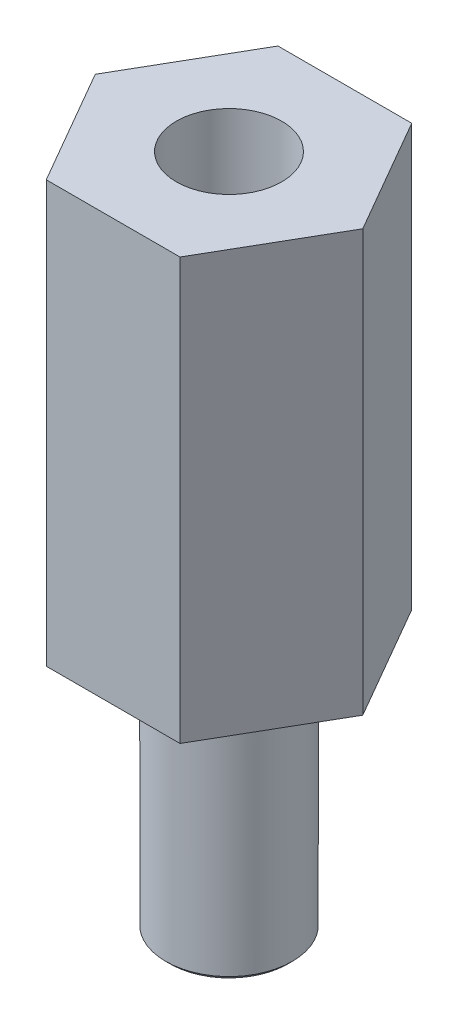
ISO-10303-21;
HEADER;
FILE_DESCRIPTION(('STEP AP214'),'2;1');
FILE_NAME('part.step','',(''),(''),'','','');
FILE_SCHEMA(('AUTOMOTIVE_DESIGN { 1 0 10303 214 1 1 1 1 }'));
ENDSEC;
DATA;
#1=APPLICATION_CONTEXT('core data for automotive mechanical design processes');
#2=APPLICATION_PROTOCOL_DEFINITION('international standard','automotive_design',2000,#1);
#3=PRODUCT_CONTEXT('',#1,'mechanical');
#4=PRODUCT('Part','Part','',(#3));
#5=PRODUCT_RELATED_PRODUCT_CATEGORY('part','',(#4));
#6=PRODUCT_DEFINITION_FORMATION('','',#4);
#7=PRODUCT_DEFINITION_CONTEXT('part definition',#1,'design');
#8=PRODUCT_DEFINITION('design','',#6,#7);
#9=PRODUCT_DEFINITION_SHAPE('','',#8);
#10=(LENGTH_UNIT() NAMED_UNIT(*) SI_UNIT(.MILLI.,.METRE.));
#11=(NAMED_UNIT(*) PLANE_ANGLE_UNIT() SI_UNIT($,.RADIAN.));
#12=(NAMED_UNIT(*) SI_UNIT($,.STERADIAN.) SOLID_ANGLE_UNIT());
#13=UNCERTAINTY_MEASURE_WITH_UNIT(LENGTH_MEASURE(1.E-05),#10,'distance_accuracy_value','');
#14=(GEOMETRIC_REPRESENTATION_CONTEXT(3) GLOBAL_UNCERTAINTY_ASSIGNED_CONTEXT((#13)) GLOBAL_UNIT_ASSIGNED_CONTEXT((#10,
#11,#12)) REPRESENTATION_CONTEXT('',''));
#15=CARTESIAN_POINT('',(0.,0.,0.));
#16=DIRECTION('',(0.,0.,1.));
#17=DIRECTION('',(1.,0.,0.));
#18=AXIS2_PLACEMENT_3D('',#15,#16,#17);
#19=CARTESIAN_POINT('',(0.,10.,0.));
#20=DIRECTION('',(0.,1.,0.));
#21=DIRECTION('',(0.,0.,1.));
#22=AXIS2_PLACEMENT_3D('',#19,#20,#21);
#23=PLANE('',#22);
#24=DIRECTION('',(0.499999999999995,0.,-0.866025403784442));
#25=VECTOR('',#24,1.);
#26=CARTESIAN_POINT('',(1.5877132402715,10.,2.74999999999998));
#27=LINE('',#26,#25);
#28=CARTESIAN_POINT('',(1.5877132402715,10.,2.74999999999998));
#29=VERTEX_POINT('',#28);
#30=CARTESIAN_POINT('',(3.17542648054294,10.,0.));
#31=VERTEX_POINT('',#30);
#32=EDGE_CURVE('E131',#29,#31,#27,.T.);
#33=ORIENTED_EDGE('',*,*,#32,.T.);
#34=DIRECTION('',(-0.500000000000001,0.,-0.866025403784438));
#35=VECTOR('',#34,1.);
#36=CARTESIAN_POINT('',(3.17542648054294,10.,0.));
#37=LINE('',#36,#35);
#38=CARTESIAN_POINT('',(1.58771324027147,10.,-2.75000000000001));
#39=VERTEX_POINT('',#38);
#40=EDGE_CURVE('E89',#31,#39,#37,.T.);
#41=ORIENTED_EDGE('',*,*,#40,.T.);
#42=DIRECTION('',(-1.,0.,0.));
#43=VECTOR('',#42,1.);
#44=CARTESIAN_POINT('',(1.58771324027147,10.,-2.75000000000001));
#45=LINE('',#44,#43);
#46=CARTESIAN_POINT('',(-1.58771324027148,10.,-2.74999999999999));
#47=VERTEX_POINT('',#46);
#48=EDGE_CURVE('E102',#39,#47,#45,.T.);
#49=ORIENTED_EDGE('',*,*,#48,.T.);
#50=DIRECTION('',(-0.499999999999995,0.,0.866025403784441));
#51=VECTOR('',#50,1.);
#52=CARTESIAN_POINT('',(-1.58771324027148,10.,-2.74999999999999));
#53=LINE('',#52,#51);
#54=CARTESIAN_POINT('',(-3.17542648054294,10.,0.));
#55=VERTEX_POINT('',#54);
#56=EDGE_CURVE('E96',#47,#55,#53,.T.);
#57=ORIENTED_EDGE('',*,*,#56,.T.);
#58=DIRECTION('',(0.500000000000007,0.,0.866025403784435));
#59=VECTOR('',#58,1.);
#60=CARTESIAN_POINT('',(-3.17542648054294,10.,0.));
#61=LINE('',#60,#59);
#62=CARTESIAN_POINT('',(-1.58771324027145,10.,2.75000000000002));
#63=VERTEX_POINT('',#62);
#64=EDGE_CURVE('E100',#55,#63,#61,.T.);
#65=ORIENTED_EDGE('',*,*,#64,.T.);
#66=DIRECTION('',(1.,0.,0.));
#67=VECTOR('',#66,1.);
#68=CARTESIAN_POINT('',(-1.58771324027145,10.,2.75000000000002));
#69=LINE('',#68,#67);
#70=EDGE_CURVE('E51',#63,#29,#69,.T.);
#71=ORIENTED_EDGE('',*,*,#70,.T.);
#72=EDGE_LOOP('',(#33,#41,#49,#57,#65,#71));
#73=FACE_BOUND('',#72,.T.);
#74=CARTESIAN_POINT('',(0.,10.,0.));
#75=DIRECTION('',(0.,1.,0.));
#76=DIRECTION('',(0.,0.,1.));
#77=AXIS2_PLACEMENT_3D('',#74,#75,#76);
#78=CIRCLE('',#77,1.25);
#79=CARTESIAN_POINT('',(0.,10.,1.25));
#80=VERTEX_POINT('',#79);
#81=EDGE_CURVE('E124',#80,#80,#78,.T.);
#82=ORIENTED_EDGE('',*,*,#81,.F.);
#83=EDGE_LOOP('',(#82));
#84=FACE_BOUND('',#83,.T.);
#85=ADVANCED_FACE('F34',(#73,#84),#23,.T.);
#86=CARTESIAN_POINT('',(0.,0.,0.));
#87=DIRECTION('',(0.,1.,0.));
#88=DIRECTION('',(0.,0.,1.));
#89=AXIS2_PLACEMENT_3D('',#86,#87,#88);
#90=PLANE('',#89);
#91=CARTESIAN_POINT('',(0.,0.,0.));
#92=DIRECTION('',(0.,1.,0.));
#93=DIRECTION('',(0.,0.,1.));
#94=AXIS2_PLACEMENT_3D('',#91,#92,#93);
#95=CIRCLE('',#94,1.5);
#96=CARTESIAN_POINT('',(0.,0.,1.5));
#97=VERTEX_POINT('',#96);
#98=EDGE_CURVE('E140',#97,#97,#95,.F.);
#99=ORIENTED_EDGE('',*,*,#98,.F.);
#100=EDGE_LOOP('',(#99));
#101=FACE_BOUND('',#100,.T.);
#102=DIRECTION('',(0.499999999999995,0.,-0.866025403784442));
#103=VECTOR('',#102,1.);
#104=CARTESIAN_POINT('',(1.5877132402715,0.,2.74999999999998));
#105=LINE('',#104,#103);
#106=CARTESIAN_POINT('',(1.5877132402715,0.,2.74999999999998));
#107=VERTEX_POINT('',#106);
#108=CARTESIAN_POINT('',(3.17542648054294,0.,0.));
#109=VERTEX_POINT('',#108);
#110=EDGE_CURVE('E120',#107,#109,#105,.T.);
#111=ORIENTED_EDGE('',*,*,#110,.F.);
#112=DIRECTION('',(1.,0.,0.));
#113=VECTOR('',#112,1.);
#114=CARTESIAN_POINT('',(-1.58771324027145,0.,2.75000000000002));
#115=LINE('',#114,#113);
#116=CARTESIAN_POINT('',(-1.58771324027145,0.,2.75000000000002));
#117=VERTEX_POINT('',#116);
#118=EDGE_CURVE('E80',#117,#107,#115,.T.);
#119=ORIENTED_EDGE('',*,*,#118,.F.);
#120=DIRECTION('',(0.500000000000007,0.,0.866025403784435));
#121=VECTOR('',#120,1.);
#122=CARTESIAN_POINT('',(-3.17542648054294,0.,0.));
#123=LINE('',#122,#121);
#124=CARTESIAN_POINT('',(-3.17542648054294,0.,0.));
#125=VERTEX_POINT('',#124);
#126=EDGE_CURVE('E74',#125,#117,#123,.T.);
#127=ORIENTED_EDGE('',*,*,#126,.F.);
#128=DIRECTION('',(-0.499999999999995,0.,0.866025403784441));
#129=VECTOR('',#128,1.);
#130=CARTESIAN_POINT('',(-1.58771324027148,0.,-2.74999999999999));
#131=LINE('',#130,#129);
#132=CARTESIAN_POINT('',(-1.58771324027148,0.,-2.74999999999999));
#133=VERTEX_POINT('',#132);
#134=EDGE_CURVE('E110',#133,#125,#131,.T.);
#135=ORIENTED_EDGE('',*,*,#134,.F.);
#136=DIRECTION('',(-1.,0.,0.));
#137=VECTOR('',#136,1.);
#138=CARTESIAN_POINT('',(1.58771324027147,0.,-2.75000000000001));
#139=LINE('',#138,#137);
#140=CARTESIAN_POINT('',(1.58771324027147,0.,-2.75000000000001));
#141=VERTEX_POINT('',#140);
#142=EDGE_CURVE('E126',#141,#133,#139,.T.);
#143=ORIENTED_EDGE('',*,*,#142,.F.);
#144=DIRECTION('',(-0.500000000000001,0.,-0.866025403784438));
#145=VECTOR('',#144,1.);
#146=CARTESIAN_POINT('',(3.17542648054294,0.,0.));
#147=LINE('',#146,#145);
#148=EDGE_CURVE('E123',#109,#141,#147,.T.);
#149=ORIENTED_EDGE('',*,*,#148,.F.);
#150=EDGE_LOOP('',(#111,#119,#127,#135,#143,#149));
#151=FACE_BOUND('',#150,.T.);
#152=ADVANCED_FACE('F156',(#101,#151),#90,.F.);
#153=CARTESIAN_POINT('',(1.5877132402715,10.,2.74999999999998));
#154=DIRECTION('',(-0.866025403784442,0.,-0.499999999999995));
#155=DIRECTION('',(-0.499999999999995,0.,0.866025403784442));
#156=AXIS2_PLACEMENT_3D('',#153,#154,#155);
#157=PLANE('',#156);
#158=ORIENTED_EDGE('',*,*,#110,.T.);
#159=DIRECTION('',(0.,-1.,0.));
#160=VECTOR('',#159,1.);
#161=CARTESIAN_POINT('',(3.17542648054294,10.,0.));
#162=LINE('',#161,#160);
#163=EDGE_CURVE('E138',#31,#109,#162,.T.);
#164=ORIENTED_EDGE('',*,*,#163,.F.);
#165=ORIENTED_EDGE('',*,*,#32,.F.);
#166=DIRECTION('',(0.,-1.,0.));
#167=VECTOR('',#166,1.);
#168=CARTESIAN_POINT('',(1.5877132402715,10.,2.74999999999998));
#169=LINE('',#168,#167);
#170=EDGE_CURVE('E116',#29,#107,#169,.T.);
#171=ORIENTED_EDGE('',*,*,#170,.T.);
#172=EDGE_LOOP('',(#158,#164,#165,#171));
#173=FACE_BOUND('',#172,.T.);
#174=ADVANCED_FACE('F161',(#173),#157,.F.);
#175=CARTESIAN_POINT('',(3.17542648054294,10.,0.));
#176=DIRECTION('',(-0.866025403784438,0.,0.500000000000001));
#177=DIRECTION('',(0.500000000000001,0.,0.866025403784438));
#178=AXIS2_PLACEMENT_3D('',#175,#176,#177);
#179=PLANE('',#178);
#180=ORIENTED_EDGE('',*,*,#148,.T.);
#181=DIRECTION('',(0.,-1.,0.));
#182=VECTOR('',#181,1.);
#183=CARTESIAN_POINT('',(1.58771324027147,10.,-2.75000000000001));
#184=LINE('',#183,#182);
#185=EDGE_CURVE('E135',#39,#141,#184,.T.);
#186=ORIENTED_EDGE('',*,*,#185,.F.);
#187=ORIENTED_EDGE('',*,*,#40,.F.);
#188=ORIENTED_EDGE('',*,*,#163,.T.);
#189=EDGE_LOOP('',(#180,#186,#187,#188));
#190=FACE_BOUND('',#189,.T.);
#191=ADVANCED_FACE('F178',(#190),#179,.F.);
#192=CARTESIAN_POINT('',(1.58771324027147,10.,-2.75000000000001));
#193=DIRECTION('',(0.,0.,1.));
#194=DIRECTION('',(1.,0.,0.));
#195=AXIS2_PLACEMENT_3D('',#192,#193,#194);
#196=PLANE('',#195);
#197=ORIENTED_EDGE('',*,*,#142,.T.);
#198=DIRECTION('',(0.,-1.,0.));
#199=VECTOR('',#198,1.);
#200=CARTESIAN_POINT('',(-1.58771324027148,10.,-2.74999999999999));
#201=LINE('',#200,#199);
#202=EDGE_CURVE('E111',#47,#133,#201,.T.);
#203=ORIENTED_EDGE('',*,*,#202,.F.);
#204=ORIENTED_EDGE('',*,*,#48,.F.);
#205=ORIENTED_EDGE('',*,*,#185,.T.);
#206=EDGE_LOOP('',(#197,#203,#204,#205));
#207=FACE_BOUND('',#206,.T.);
#208=ADVANCED_FACE('F175',(#207),#196,.F.);
#209=CARTESIAN_POINT('',(-1.58771324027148,10.,-2.74999999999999));
#210=DIRECTION('',(0.866025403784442,0.,0.499999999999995));
#211=DIRECTION('',(0.499999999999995,0.,-0.866025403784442));
#212=AXIS2_PLACEMENT_3D('',#209,#210,#211);
#213=PLANE('',#212);
#214=ORIENTED_EDGE('',*,*,#134,.T.);
#215=DIRECTION('',(0.,-1.,0.));
#216=VECTOR('',#215,1.);
#217=CARTESIAN_POINT('',(-3.17542648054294,10.,0.));
#218=LINE('',#217,#216);
#219=EDGE_CURVE('E107',#55,#125,#218,.T.);
#220=ORIENTED_EDGE('',*,*,#219,.F.);
#221=ORIENTED_EDGE('',*,*,#56,.F.);
#222=ORIENTED_EDGE('',*,*,#202,.T.);
#223=EDGE_LOOP('',(#214,#220,#221,#222));
#224=FACE_BOUND('',#223,.T.);
#225=ADVANCED_FACE('F108',(#224),#213,.F.);
#226=CARTESIAN_POINT('',(-3.17542648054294,10.,0.));
#227=DIRECTION('',(0.866025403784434,0.,-0.500000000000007));
#228=DIRECTION('',(-0.500000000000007,0.,-0.866025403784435));
#229=AXIS2_PLACEMENT_3D('',#226,#227,#228);
#230=PLANE('',#229);
#231=ORIENTED_EDGE('',*,*,#126,.T.);
#232=DIRECTION('',(0.,-1.,0.));
#233=VECTOR('',#232,1.);
#234=CARTESIAN_POINT('',(-1.58771324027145,10.,2.75000000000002));
#235=LINE('',#234,#233);
#236=EDGE_CURVE('E112',#63,#117,#235,.T.);
#237=ORIENTED_EDGE('',*,*,#236,.F.);
#238=ORIENTED_EDGE('',*,*,#64,.F.);
#239=ORIENTED_EDGE('',*,*,#219,.T.);
#240=EDGE_LOOP('',(#231,#237,#238,#239));
#241=FACE_BOUND('',#240,.T.);
#242=ADVANCED_FACE('F114',(#241),#230,.F.);
#243=CARTESIAN_POINT('',(-1.58771324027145,10.,2.75000000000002));
#244=DIRECTION('',(0.,0.,-1.));
#245=DIRECTION('',(-1.,0.,0.));
#246=AXIS2_PLACEMENT_3D('',#243,#244,#245);
#247=PLANE('',#246);
#248=ORIENTED_EDGE('',*,*,#118,.T.);
#249=ORIENTED_EDGE('',*,*,#170,.F.);
#250=ORIENTED_EDGE('',*,*,#70,.F.);
#251=ORIENTED_EDGE('',*,*,#236,.T.);
#252=EDGE_LOOP('',(#248,#249,#250,#251));
#253=FACE_BOUND('',#252,.T.);
#254=ADVANCED_FACE('F168',(#253),#247,.F.);
#255=CARTESIAN_POINT('',(0.,10.,0.));
#256=DIRECTION('',(0.,-1.,0.));
#257=DIRECTION('',(0.,0.,-1.));
#258=AXIS2_PLACEMENT_3D('',#255,#256,#257);
#259=CYLINDRICAL_SURFACE('',#258,1.25);
#260=ORIENTED_EDGE('',*,*,#81,.T.);
#261=EDGE_LOOP('',(#260));
#262=FACE_BOUND('',#261,.T.);
#263=CARTESIAN_POINT('',(0.,0.,0.));
#264=DIRECTION('',(0.,1.,0.));
#265=DIRECTION('',(0.,0.,1.));
#266=AXIS2_PLACEMENT_3D('',#263,#264,#265);
#267=CIRCLE('',#266,1.25);
#268=CARTESIAN_POINT('',(0.,0.,1.25));
#269=VERTEX_POINT('',#268);
#270=EDGE_CURVE('E193',#269,#269,#267,.T.);
#271=ORIENTED_EDGE('',*,*,#270,.F.);
#272=EDGE_LOOP('',(#271));
#273=FACE_BOUND('',#272,.T.);
#274=ADVANCED_FACE('F165',(#262,#273),#259,.F.);
#275=CARTESIAN_POINT('',(0.,0.,0.));
#276=DIRECTION('',(0.,-1.,0.));
#277=DIRECTION('',(0.,0.,-1.));
#278=AXIS2_PLACEMENT_3D('',#275,#276,#277);
#279=PLANE('',#278);
#280=ORIENTED_EDGE('',*,*,#270,.T.);
#281=EDGE_LOOP('',(#280));
#282=FACE_BOUND('',#281,.T.);
#283=ADVANCED_FACE('F201',(#282),#279,.F.);
#284=CARTESIAN_POINT('',(0.,-6.,0.));
#285=DIRECTION('',(0.,1.,0.));
#286=DIRECTION('',(0.,0.,1.));
#287=AXIS2_PLACEMENT_3D('',#284,#285,#286);
#288=CYLINDRICAL_SURFACE('',#287,1.5);
#289=CARTESIAN_POINT('',(0.,-5.9,0.));
#290=DIRECTION('',(0.,-1.,0.));
#291=DIRECTION('',(0.,0.,-1.));
#292=AXIS2_PLACEMENT_3D('',#289,#290,#291);
#293=CIRCLE('',#292,1.5);
#294=CARTESIAN_POINT('',(0.,-5.9,-1.5));
#295=VERTEX_POINT('',#294);
#296=EDGE_CURVE('E11',#295,#295,#293,.F.);
#297=ORIENTED_EDGE('',*,*,#296,.T.);
#298=EDGE_LOOP('',(#297));
#299=FACE_BOUND('',#298,.T.);
#300=ORIENTED_EDGE('',*,*,#98,.T.);
#301=EDGE_LOOP('',(#300));
#302=FACE_BOUND('',#301,.T.);
#303=ADVANCED_FACE('F152',(#299,#302),#288,.T.);
#304=CARTESIAN_POINT('',(0.,-6.,0.));
#305=DIRECTION('',(0.,-1.,0.));
#306=DIRECTION('',(0.,0.,-1.));
#307=AXIS2_PLACEMENT_3D('',#304,#305,#306);
#308=PLANE('',#307);
#309=CARTESIAN_POINT('',(0.,-6.,0.));
#310=DIRECTION('',(0.,-1.,0.));
#311=DIRECTION('',(0.,0.,-1.));
#312=AXIS2_PLACEMENT_3D('',#309,#310,#311);
#313=CIRCLE('',#312,1.4);
#314=CARTESIAN_POINT('',(0.,-6.,-1.4));
#315=VERTEX_POINT('',#314);
#316=EDGE_CURVE('E43',#315,#315,#313,.T.);
#317=ORIENTED_EDGE('',*,*,#316,.T.);
#318=EDGE_LOOP('',(#317));
#319=FACE_BOUND('',#318,.T.);
#320=ADVANCED_FACE('F145',(#319),#308,.T.);
#321=CARTESIAN_POINT('',(0.,-6.,0.));
#322=DIRECTION('',(0.,1.,0.));
#323=DIRECTION('',(0.,0.,1.));
#324=AXIS2_PLACEMENT_3D('',#321,#322,#323);
#325=CONICAL_SURFACE('',#324,1.4,0.785398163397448);
#326=ORIENTED_EDGE('',*,*,#296,.F.);
#327=EDGE_LOOP('',(#326));
#328=FACE_BOUND('',#327,.T.);
#329=ORIENTED_EDGE('',*,*,#316,.F.);
#330=EDGE_LOOP('',(#329));
#331=FACE_BOUND('',#330,.T.);
#332=ADVANCED_FACE('F36',(#328,#331),#325,.T.);
#333=CLOSED_SHELL('',(#85,#152,#174,#191,#208,#225,#242,#254,#274,#283,#303,#320,#332));
#334=MANIFOLD_SOLID_BREP('B2',#333);
#335=ADVANCED_BREP_SHAPE_REPRESENTATION('',(#18,#334),#14);
#336=SHAPE_DEFINITION_REPRESENTATION(#9,#335);
ENDSEC;
END-ISO-10303-21;
